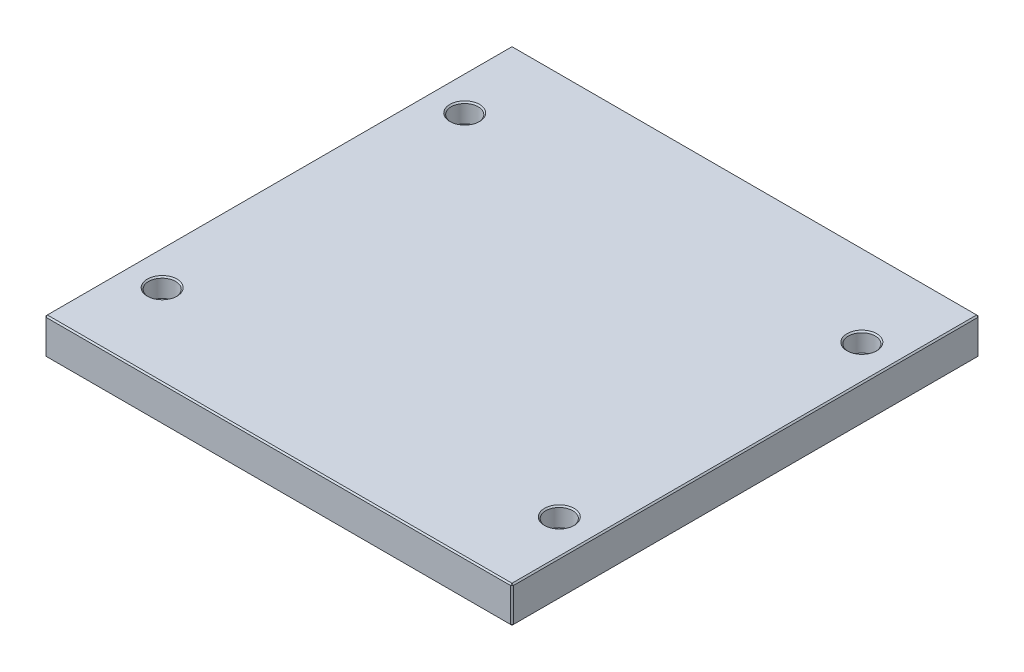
ISO-10303-21;
HEADER;
FILE_DESCRIPTION(('STEP AP214'),'2;1');
FILE_NAME('part.step','',(''),(''),'','','');
FILE_SCHEMA(('AUTOMOTIVE_DESIGN { 1 0 10303 214 1 1 1 1 }'));
ENDSEC;
DATA;
#1=APPLICATION_CONTEXT('core data for automotive mechanical design processes');
#2=APPLICATION_PROTOCOL_DEFINITION('international standard','automotive_design',2000,#1);
#3=PRODUCT_CONTEXT('',#1,'mechanical');
#4=PRODUCT('Part','Part','',(#3));
#5=PRODUCT_RELATED_PRODUCT_CATEGORY('part','',(#4));
#6=PRODUCT_DEFINITION_FORMATION('','',#4);
#7=PRODUCT_DEFINITION_CONTEXT('part definition',#1,'design');
#8=PRODUCT_DEFINITION('design','',#6,#7);
#9=PRODUCT_DEFINITION_SHAPE('','',#8);
#10=(LENGTH_UNIT() NAMED_UNIT(*) SI_UNIT(.MILLI.,.METRE.));
#11=(NAMED_UNIT(*) PLANE_ANGLE_UNIT() SI_UNIT($,.RADIAN.));
#12=(NAMED_UNIT(*) SI_UNIT($,.STERADIAN.) SOLID_ANGLE_UNIT());
#13=UNCERTAINTY_MEASURE_WITH_UNIT(LENGTH_MEASURE(1.E-05),#10,'distance_accuracy_value','');
#14=(GEOMETRIC_REPRESENTATION_CONTEXT(3) GLOBAL_UNCERTAINTY_ASSIGNED_CONTEXT((#13)) GLOBAL_UNIT_ASSIGNED_CONTEXT((#10,
#11,#12)) REPRESENTATION_CONTEXT('',''));
#15=CARTESIAN_POINT('',(0.,0.,0.));
#16=DIRECTION('',(0.,0.,1.));
#17=DIRECTION('',(1.,0.,0.));
#18=AXIS2_PLACEMENT_3D('',#15,#16,#17);
#19=CARTESIAN_POINT('',(-173.,27.,173.));
#20=DIRECTION('',(1.,0.,0.));
#21=DIRECTION('',(0.,0.,-1.));
#22=AXIS2_PLACEMENT_3D('',#19,#20,#21);
#23=PLANE('',#22);
#24=DIRECTION('',(0.,-1.,0.));
#25=VECTOR('',#24,1.);
#26=CARTESIAN_POINT('',(-173.,27.,-172.));
#27=LINE('',#26,#25);
#28=CARTESIAN_POINT('',(-173.,26.,-172.));
#29=VERTEX_POINT('',#28);
#30=CARTESIAN_POINT('',(-173.,0.999999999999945,-172.));
#31=VERTEX_POINT('',#30);
#32=EDGE_CURVE('E115',#29,#31,#27,.T.);
#33=ORIENTED_EDGE('',*,*,#32,.T.);
#34=DIRECTION('',(0.,0.,1.));
#35=VECTOR('',#34,1.);
#36=CARTESIAN_POINT('',(-173.,0.999999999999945,173.));
#37=LINE('',#36,#35);
#38=CARTESIAN_POINT('',(-173.,0.999999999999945,172.));
#39=VERTEX_POINT('',#38);
#40=EDGE_CURVE('E111',#31,#39,#37,.T.);
#41=ORIENTED_EDGE('',*,*,#40,.T.);
#42=DIRECTION('',(0.,1.,0.));
#43=VECTOR('',#42,1.);
#44=CARTESIAN_POINT('',(-173.,27.,172.));
#45=LINE('',#44,#43);
#46=CARTESIAN_POINT('',(-173.,26.,172.));
#47=VERTEX_POINT('',#46);
#48=EDGE_CURVE('E104',#39,#47,#45,.T.);
#49=ORIENTED_EDGE('',*,*,#48,.T.);
#50=DIRECTION('',(0.,0.,-1.));
#51=VECTOR('',#50,1.);
#52=CARTESIAN_POINT('',(-173.,26.,-173.));
#53=LINE('',#52,#51);
#54=EDGE_CURVE('E108',#47,#29,#53,.T.);
#55=ORIENTED_EDGE('',*,*,#54,.T.);
#56=EDGE_LOOP('',(#33,#41,#49,#55));
#57=FACE_BOUND('',#56,.T.);
#58=ADVANCED_FACE('F16',(#57),#23,.F.);
#59=CARTESIAN_POINT('',(173.,27.,173.));
#60=DIRECTION('',(0.,0.,-1.));
#61=DIRECTION('',(-1.,0.,0.));
#62=AXIS2_PLACEMENT_3D('',#59,#60,#61);
#63=PLANE('',#62);
#64=DIRECTION('',(-1.,0.,0.));
#65=VECTOR('',#64,1.);
#66=CARTESIAN_POINT('',(-173.,26.,173.));
#67=LINE('',#66,#65);
#68=CARTESIAN_POINT('',(172.,26.,173.));
#69=VERTEX_POINT('',#68);
#70=CARTESIAN_POINT('',(-172.,26.,173.));
#71=VERTEX_POINT('',#70);
#72=EDGE_CURVE('E170',#69,#71,#67,.T.);
#73=ORIENTED_EDGE('',*,*,#72,.T.);
#74=DIRECTION('',(0.,-1.,0.));
#75=VECTOR('',#74,1.);
#76=CARTESIAN_POINT('',(-172.,27.,173.));
#77=LINE('',#76,#75);
#78=CARTESIAN_POINT('',(-172.,1.,173.));
#79=VERTEX_POINT('',#78);
#80=EDGE_CURVE('E123',#71,#79,#77,.T.);
#81=ORIENTED_EDGE('',*,*,#80,.T.);
#82=DIRECTION('',(1.,0.,0.));
#83=VECTOR('',#82,1.);
#84=CARTESIAN_POINT('',(173.,1.,173.));
#85=LINE('',#84,#83);
#86=CARTESIAN_POINT('',(172.,1.,173.));
#87=VERTEX_POINT('',#86);
#88=EDGE_CURVE('E174',#79,#87,#85,.T.);
#89=ORIENTED_EDGE('',*,*,#88,.T.);
#90=DIRECTION('',(0.,1.,0.));
#91=VECTOR('',#90,1.);
#92=CARTESIAN_POINT('',(172.,27.,173.));
#93=LINE('',#92,#91);
#94=EDGE_CURVE('E172',#87,#69,#93,.T.);
#95=ORIENTED_EDGE('',*,*,#94,.T.);
#96=EDGE_LOOP('',(#73,#81,#89,#95));
#97=FACE_BOUND('',#96,.T.);
#98=ADVANCED_FACE('F317',(#97),#63,.F.);
#99=CARTESIAN_POINT('',(173.,27.,173.));
#100=DIRECTION('',(-1.,0.,0.));
#101=DIRECTION('',(0.,0.,1.));
#102=AXIS2_PLACEMENT_3D('',#99,#100,#101);
#103=PLANE('',#102);
#104=DIRECTION('',(0.,0.,-1.));
#105=VECTOR('',#104,1.);
#106=CARTESIAN_POINT('',(173.,1.,173.));
#107=LINE('',#106,#105);
#108=CARTESIAN_POINT('',(173.,1.,172.));
#109=VERTEX_POINT('',#108);
#110=CARTESIAN_POINT('',(173.,1.,-172.));
#111=VERTEX_POINT('',#110);
#112=EDGE_CURVE('E165',#109,#111,#107,.T.);
#113=ORIENTED_EDGE('',*,*,#112,.T.);
#114=DIRECTION('',(0.,1.,0.));
#115=VECTOR('',#114,1.);
#116=CARTESIAN_POINT('',(173.,27.,-172.));
#117=LINE('',#116,#115);
#118=CARTESIAN_POINT('',(173.,26.,-172.));
#119=VERTEX_POINT('',#118);
#120=EDGE_CURVE('E167',#111,#119,#117,.T.);
#121=ORIENTED_EDGE('',*,*,#120,.T.);
#122=DIRECTION('',(0.,0.,1.));
#123=VECTOR('',#122,1.);
#124=CARTESIAN_POINT('',(173.,26.,173.));
#125=LINE('',#124,#123);
#126=CARTESIAN_POINT('',(173.,26.,172.));
#127=VERTEX_POINT('',#126);
#128=EDGE_CURVE('E161',#119,#127,#125,.T.);
#129=ORIENTED_EDGE('',*,*,#128,.T.);
#130=DIRECTION('',(0.,-1.,0.));
#131=VECTOR('',#130,1.);
#132=CARTESIAN_POINT('',(173.,27.,172.));
#133=LINE('',#132,#131);
#134=EDGE_CURVE('E163',#127,#109,#133,.T.);
#135=ORIENTED_EDGE('',*,*,#134,.T.);
#136=EDGE_LOOP('',(#113,#121,#129,#135));
#137=FACE_BOUND('',#136,.T.);
#138=ADVANCED_FACE('F323',(#137),#103,.F.);
#139=CARTESIAN_POINT('',(173.,27.,-173.));
#140=DIRECTION('',(0.,0.,1.));
#141=DIRECTION('',(1.,0.,0.));
#142=AXIS2_PLACEMENT_3D('',#139,#140,#141);
#143=PLANE('',#142);
#144=DIRECTION('',(0.,-1.,0.));
#145=VECTOR('',#144,1.);
#146=CARTESIAN_POINT('',(172.,27.,-173.));
#147=LINE('',#146,#145);
#148=CARTESIAN_POINT('',(172.,26.,-173.));
#149=VERTEX_POINT('',#148);
#150=CARTESIAN_POINT('',(172.,1.,-173.));
#151=VERTEX_POINT('',#150);
#152=EDGE_CURVE('E154',#149,#151,#147,.T.);
#153=ORIENTED_EDGE('',*,*,#152,.T.);
#154=DIRECTION('',(-1.,0.,0.));
#155=VECTOR('',#154,1.);
#156=CARTESIAN_POINT('',(173.,1.,-173.));
#157=LINE('',#156,#155);
#158=CARTESIAN_POINT('',(-172.,1.,-173.));
#159=VERTEX_POINT('',#158);
#160=EDGE_CURVE('E159',#151,#159,#157,.T.);
#161=ORIENTED_EDGE('',*,*,#160,.T.);
#162=DIRECTION('',(0.,1.,0.));
#163=VECTOR('',#162,1.);
#164=CARTESIAN_POINT('',(-172.,27.,-173.));
#165=LINE('',#164,#163);
#166=CARTESIAN_POINT('',(-172.,26.,-173.));
#167=VERTEX_POINT('',#166);
#168=EDGE_CURVE('E156',#159,#167,#165,.T.);
#169=ORIENTED_EDGE('',*,*,#168,.T.);
#170=DIRECTION('',(1.,0.,0.));
#171=VECTOR('',#170,1.);
#172=CARTESIAN_POINT('',(173.,26.,-173.));
#173=LINE('',#172,#171);
#174=EDGE_CURVE('E152',#167,#149,#173,.T.);
#175=ORIENTED_EDGE('',*,*,#174,.T.);
#176=EDGE_LOOP('',(#153,#161,#169,#175));
#177=FACE_BOUND('',#176,.T.);
#178=ADVANCED_FACE('F465',(#177),#143,.F.);
#179=CARTESIAN_POINT('',(0.,27.,0.));
#180=DIRECTION('',(0.,1.,0.));
#181=DIRECTION('',(0.,0.,1.));
#182=AXIS2_PLACEMENT_3D('',#179,#180,#181);
#183=PLANE('',#182);
#184=CARTESIAN_POINT('',(-147.,27.,112.));
#185=DIRECTION('',(0.,1.,0.));
#186=DIRECTION('',(0.,0.,1.));
#187=AXIS2_PLACEMENT_3D('',#184,#185,#186);
#188=CIRCLE('',#187,11.0000000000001);
#189=CARTESIAN_POINT('',(-147.,27.,123.));
#190=VERTEX_POINT('',#189);
#191=EDGE_CURVE('E290',#190,#190,#188,.F.);
#192=ORIENTED_EDGE('',*,*,#191,.T.);
#193=EDGE_LOOP('',(#192));
#194=FACE_BOUND('',#193,.T.);
#195=CARTESIAN_POINT('',(147.,27.,112.));
#196=DIRECTION('',(0.,1.,0.));
#197=DIRECTION('',(0.,0.,1.));
#198=AXIS2_PLACEMENT_3D('',#195,#196,#197);
#199=CIRCLE('',#198,11.0000000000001);
#200=CARTESIAN_POINT('',(147.,27.,123.));
#201=VERTEX_POINT('',#200);
#202=EDGE_CURVE('E287',#201,#201,#199,.F.);
#203=ORIENTED_EDGE('',*,*,#202,.T.);
#204=EDGE_LOOP('',(#203));
#205=FACE_BOUND('',#204,.T.);
#206=CARTESIAN_POINT('',(147.,27.,-112.));
#207=DIRECTION('',(0.,1.,0.));
#208=DIRECTION('',(0.,0.,1.));
#209=AXIS2_PLACEMENT_3D('',#206,#207,#208);
#210=CIRCLE('',#209,11.0000000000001);
#211=CARTESIAN_POINT('',(147.,27.,-101.));
#212=VERTEX_POINT('',#211);
#213=EDGE_CURVE('E284',#212,#212,#210,.F.);
#214=ORIENTED_EDGE('',*,*,#213,.T.);
#215=EDGE_LOOP('',(#214));
#216=FACE_BOUND('',#215,.T.);
#217=CARTESIAN_POINT('',(-147.,27.,-112.));
#218=DIRECTION('',(0.,1.,0.));
#219=DIRECTION('',(0.,0.,1.));
#220=AXIS2_PLACEMENT_3D('',#217,#218,#219);
#221=CIRCLE('',#220,11.0000000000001);
#222=CARTESIAN_POINT('',(-147.,27.,-101.));
#223=VERTEX_POINT('',#222);
#224=EDGE_CURVE('E281',#223,#223,#221,.F.);
#225=ORIENTED_EDGE('',*,*,#224,.T.);
#226=EDGE_LOOP('',(#225));
#227=FACE_BOUND('',#226,.T.);
#228=DIRECTION('',(0.,0.,-1.));
#229=VECTOR('',#228,1.);
#230=CARTESIAN_POINT('',(172.,27.,-173.));
#231=LINE('',#230,#229);
#232=CARTESIAN_POINT('',(172.,27.,172.));
#233=VERTEX_POINT('',#232);
#234=CARTESIAN_POINT('',(172.,27.,-172.));
#235=VERTEX_POINT('',#234);
#236=EDGE_CURVE('E31',#233,#235,#231,.T.);
#237=ORIENTED_EDGE('',*,*,#236,.T.);
#238=DIRECTION('',(-1.,0.,0.));
#239=VECTOR('',#238,1.);
#240=CARTESIAN_POINT('',(-173.,27.,-172.));
#241=LINE('',#240,#239);
#242=CARTESIAN_POINT('',(-172.,27.,-172.));
#243=VERTEX_POINT('',#242);
#244=EDGE_CURVE('E190',#235,#243,#241,.T.);
#245=ORIENTED_EDGE('',*,*,#244,.T.);
#246=DIRECTION('',(0.,0.,1.));
#247=VECTOR('',#246,1.);
#248=CARTESIAN_POINT('',(-172.,27.,173.));
#249=LINE('',#248,#247);
#250=CARTESIAN_POINT('',(-172.,27.,172.));
#251=VERTEX_POINT('',#250);
#252=EDGE_CURVE('E186',#243,#251,#249,.T.);
#253=ORIENTED_EDGE('',*,*,#252,.T.);
#254=DIRECTION('',(1.,0.,0.));
#255=VECTOR('',#254,1.);
#256=CARTESIAN_POINT('',(173.,27.,172.));
#257=LINE('',#256,#255);
#258=EDGE_CURVE('E36',#251,#233,#257,.T.);
#259=ORIENTED_EDGE('',*,*,#258,.T.);
#260=EDGE_LOOP('',(#237,#245,#253,#259));
#261=FACE_BOUND('',#260,.T.);
#262=ADVANCED_FACE('F462',(#194,#205,#216,#227,#261),#183,.T.);
#263=CARTESIAN_POINT('',(0.,0.,0.));
#264=DIRECTION('',(0.,1.,0.));
#265=DIRECTION('',(0.,0.,1.));
#266=AXIS2_PLACEMENT_3D('',#263,#264,#265);
#267=PLANE('',#266);
#268=CARTESIAN_POINT('',(147.,0.,-112.));
#269=DIRECTION('',(0.,1.,0.));
#270=DIRECTION('',(0.,0.,1.));
#271=AXIS2_PLACEMENT_3D('',#268,#269,#270);
#272=CIRCLE('',#271,8.);
#273=CARTESIAN_POINT('',(147.,0.,-104.));
#274=VERTEX_POINT('',#273);
#275=EDGE_CURVE('E263',#274,#274,#272,.T.);
#276=ORIENTED_EDGE('',*,*,#275,.T.);
#277=EDGE_LOOP('',(#276));
#278=FACE_BOUND('',#277,.T.);
#279=CARTESIAN_POINT('',(147.,0.,112.));
#280=DIRECTION('',(0.,1.,0.));
#281=DIRECTION('',(0.,0.,1.));
#282=AXIS2_PLACEMENT_3D('',#279,#280,#281);
#283=CIRCLE('',#282,8.);
#284=CARTESIAN_POINT('',(147.,0.,120.));
#285=VERTEX_POINT('',#284);
#286=EDGE_CURVE('E260',#285,#285,#283,.T.);
#287=ORIENTED_EDGE('',*,*,#286,.T.);
#288=EDGE_LOOP('',(#287));
#289=FACE_BOUND('',#288,.T.);
#290=CARTESIAN_POINT('',(-147.,0.,112.));
#291=DIRECTION('',(0.,1.,0.));
#292=DIRECTION('',(0.,0.,1.));
#293=AXIS2_PLACEMENT_3D('',#290,#291,#292);
#294=CIRCLE('',#293,8.);
#295=CARTESIAN_POINT('',(-147.,0.,120.));
#296=VERTEX_POINT('',#295);
#297=EDGE_CURVE('E257',#296,#296,#294,.T.);
#298=ORIENTED_EDGE('',*,*,#297,.T.);
#299=EDGE_LOOP('',(#298));
#300=FACE_BOUND('',#299,.T.);
#301=CARTESIAN_POINT('',(-147.,0.,-112.));
#302=DIRECTION('',(0.,1.,0.));
#303=DIRECTION('',(0.,0.,1.));
#304=AXIS2_PLACEMENT_3D('',#301,#302,#303);
#305=CIRCLE('',#304,8.);
#306=CARTESIAN_POINT('',(-147.,0.,-104.));
#307=VERTEX_POINT('',#306);
#308=EDGE_CURVE('E192',#307,#307,#305,.T.);
#309=ORIENTED_EDGE('',*,*,#308,.T.);
#310=EDGE_LOOP('',(#309));
#311=FACE_BOUND('',#310,.T.);
#312=DIRECTION('',(0.,0.,1.));
#313=VECTOR('',#312,1.);
#314=CARTESIAN_POINT('',(172.,0.,0.));
#315=LINE('',#314,#313);
#316=CARTESIAN_POINT('',(172.,0.,-172.));
#317=VERTEX_POINT('',#316);
#318=CARTESIAN_POINT('',(172.,0.,172.));
#319=VERTEX_POINT('',#318);
#320=EDGE_CURVE('E177',#317,#319,#315,.T.);
#321=ORIENTED_EDGE('',*,*,#320,.T.);
#322=DIRECTION('',(-1.,0.,0.));
#323=VECTOR('',#322,1.);
#324=CARTESIAN_POINT('',(0.,0.,172.));
#325=LINE('',#324,#323);
#326=CARTESIAN_POINT('',(-172.,0.,172.));
#327=VERTEX_POINT('',#326);
#328=EDGE_CURVE('E183',#319,#327,#325,.T.);
#329=ORIENTED_EDGE('',*,*,#328,.T.);
#330=DIRECTION('',(0.,0.,-1.));
#331=VECTOR('',#330,1.);
#332=CARTESIAN_POINT('',(-172.,0.,0.));
#333=LINE('',#332,#331);
#334=CARTESIAN_POINT('',(-172.,0.,-172.));
#335=VERTEX_POINT('',#334);
#336=EDGE_CURVE('E181',#327,#335,#333,.T.);
#337=ORIENTED_EDGE('',*,*,#336,.T.);
#338=DIRECTION('',(1.,0.,0.));
#339=VECTOR('',#338,1.);
#340=CARTESIAN_POINT('',(0.,0.,-172.));
#341=LINE('',#340,#339);
#342=EDGE_CURVE('E179',#335,#317,#341,.T.);
#343=ORIENTED_EDGE('',*,*,#342,.T.);
#344=EDGE_LOOP('',(#321,#329,#337,#343));
#345=FACE_BOUND('',#344,.T.);
#346=ADVANCED_FACE('F402',(#278,#289,#300,#311,#345),#267,.F.);
#347=CARTESIAN_POINT('',(173.,27.,172.));
#348=DIRECTION('',(-0.707106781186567,0.,-0.707106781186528));
#349=DIRECTION('',(0.,-1.,0.));
#350=AXIS2_PLACEMENT_3D('',#347,#348,#349);
#351=PLANE('',#350);
#352=DIRECTION('',(-0.707106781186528,0.,0.707106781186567));
#353=VECTOR('',#352,1.);
#354=CARTESIAN_POINT('',(172.,26.,173.));
#355=LINE('',#354,#353);
#356=EDGE_CURVE('E141',#69,#127,#355,.F.);
#357=ORIENTED_EDGE('',*,*,#356,.F.);
#358=ORIENTED_EDGE('',*,*,#94,.F.);
#359=DIRECTION('',(0.707106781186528,0.,-0.707106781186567));
#360=VECTOR('',#359,1.);
#361=CARTESIAN_POINT('',(172.,1.,173.));
#362=LINE('',#361,#360);
#363=EDGE_CURVE('E144',#109,#87,#362,.F.);
#364=ORIENTED_EDGE('',*,*,#363,.F.);
#365=ORIENTED_EDGE('',*,*,#134,.F.);
#366=EDGE_LOOP('',(#357,#358,#364,#365));
#367=FACE_BOUND('',#366,.T.);
#368=ADVANCED_FACE('F398',(#367),#351,.F.);
#369=CARTESIAN_POINT('',(172.,26.,173.));
#370=DIRECTION('',(0.577350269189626,0.577350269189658,0.577350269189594));
#371=DIRECTION('',(-0.707106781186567,0.707106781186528,0.));
#372=AXIS2_PLACEMENT_3D('',#369,#370,#371);
#373=PLANE('',#372);
#374=DIRECTION('',(0.,-0.707106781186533,0.707106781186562));
#375=VECTOR('',#374,1.);
#376=CARTESIAN_POINT('',(172.,26.,173.));
#377=LINE('',#376,#375);
#378=EDGE_CURVE('E235',#69,#233,#377,.F.);
#379=ORIENTED_EDGE('',*,*,#378,.F.);
#380=ORIENTED_EDGE('',*,*,#356,.T.);
#381=DIRECTION('',(-0.707106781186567,0.707106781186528,0.));
#382=VECTOR('',#381,1.);
#383=CARTESIAN_POINT('',(172.5,26.5,172.));
#384=LINE('',#383,#382);
#385=EDGE_CURVE('E237',#233,#127,#384,.F.);
#386=ORIENTED_EDGE('',*,*,#385,.F.);
#387=EDGE_LOOP('',(#379,#380,#386));
#388=FACE_BOUND('',#387,.T.);
#389=ADVANCED_FACE('F394',(#388),#373,.T.);
#390=CARTESIAN_POINT('',(172.,1.,173.));
#391=DIRECTION('',(0.577350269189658,-0.577350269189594,0.577350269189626));
#392=DIRECTION('',(0.707106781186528,0.,-0.707106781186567));
#393=AXIS2_PLACEMENT_3D('',#390,#391,#392);
#394=PLANE('',#393);
#395=DIRECTION('',(-0.707106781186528,-0.707106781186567,0.));
#396=VECTOR('',#395,1.);
#397=CARTESIAN_POINT('',(172.5,0.5,172.));
#398=LINE('',#397,#396);
#399=EDGE_CURVE('E229',#109,#319,#398,.T.);
#400=ORIENTED_EDGE('',*,*,#399,.F.);
#401=ORIENTED_EDGE('',*,*,#363,.T.);
#402=DIRECTION('',(0.,0.707106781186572,0.707106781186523));
#403=VECTOR('',#402,1.);
#404=CARTESIAN_POINT('',(172.,1.,173.));
#405=LINE('',#404,#403);
#406=EDGE_CURVE('E232',#319,#87,#405,.T.);
#407=ORIENTED_EDGE('',*,*,#406,.F.);
#408=EDGE_LOOP('',(#400,#401,#407));
#409=FACE_BOUND('',#408,.T.);
#410=ADVANCED_FACE('F390',(#409),#394,.T.);
#411=CARTESIAN_POINT('',(172.,27.,0.));
#412=DIRECTION('',(0.707106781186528,0.707106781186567,0.));
#413=DIRECTION('',(0.,0.,1.));
#414=AXIS2_PLACEMENT_3D('',#411,#412,#413);
#415=PLANE('',#414);
#416=ORIENTED_EDGE('',*,*,#385,.T.);
#417=ORIENTED_EDGE('',*,*,#128,.F.);
#418=DIRECTION('',(0.707106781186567,-0.707106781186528,0.));
#419=VECTOR('',#418,1.);
#420=CARTESIAN_POINT('',(173.,26.,-172.));
#421=LINE('',#420,#419);
#422=EDGE_CURVE('E224',#235,#119,#421,.T.);
#423=ORIENTED_EDGE('',*,*,#422,.F.);
#424=ORIENTED_EDGE('',*,*,#236,.F.);
#425=EDGE_LOOP('',(#416,#417,#423,#424));
#426=FACE_BOUND('',#425,.T.);
#427=ADVANCED_FACE('F386',(#426),#415,.T.);
#428=CARTESIAN_POINT('',(0.,27.,172.));
#429=DIRECTION('',(0.,0.707106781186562,0.707106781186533));
#430=DIRECTION('',(-1.,0.,0.));
#431=AXIS2_PLACEMENT_3D('',#428,#429,#430);
#432=PLANE('',#431);
#433=ORIENTED_EDGE('',*,*,#378,.T.);
#434=ORIENTED_EDGE('',*,*,#258,.F.);
#435=DIRECTION('',(0.,0.707106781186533,-0.707106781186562));
#436=VECTOR('',#435,1.);
#437=CARTESIAN_POINT('',(-172.,26.5,172.5));
#438=LINE('',#437,#436);
#439=EDGE_CURVE('E127',#71,#251,#438,.T.);
#440=ORIENTED_EDGE('',*,*,#439,.F.);
#441=ORIENTED_EDGE('',*,*,#72,.F.);
#442=EDGE_LOOP('',(#433,#434,#440,#441));
#443=FACE_BOUND('',#442,.T.);
#444=ADVANCED_FACE('F383',(#443),#432,.T.);
#445=CARTESIAN_POINT('',(-172.,27.,173.));
#446=DIRECTION('',(0.707106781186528,0.,-0.707106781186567));
#447=DIRECTION('',(0.,-1.,0.));
#448=AXIS2_PLACEMENT_3D('',#445,#446,#447);
#449=PLANE('',#448);
#450=DIRECTION('',(0.707106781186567,0.,0.707106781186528));
#451=VECTOR('',#450,1.);
#452=CARTESIAN_POINT('',(-172.,1.,173.));
#453=LINE('',#452,#451);
#454=EDGE_CURVE('E128',#79,#39,#453,.F.);
#455=ORIENTED_EDGE('',*,*,#454,.F.);
#456=ORIENTED_EDGE('',*,*,#80,.F.);
#457=DIRECTION('',(-0.707106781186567,0.,-0.707106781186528));
#458=VECTOR('',#457,1.);
#459=CARTESIAN_POINT('',(-173.,26.,172.));
#460=LINE('',#459,#458);
#461=EDGE_CURVE('E119',#47,#71,#460,.F.);
#462=ORIENTED_EDGE('',*,*,#461,.F.);
#463=ORIENTED_EDGE('',*,*,#48,.F.);
#464=EDGE_LOOP('',(#455,#456,#462,#463));
#465=FACE_BOUND('',#464,.T.);
#466=ADVANCED_FACE('F121',(#465),#449,.F.);
#467=CARTESIAN_POINT('',(173.,1.,173.));
#468=DIRECTION('',(0.,0.707106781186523,-0.707106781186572));
#469=DIRECTION('',(1.,0.,0.));
#470=AXIS2_PLACEMENT_3D('',#467,#468,#469);
#471=PLANE('',#470);
#472=ORIENTED_EDGE('',*,*,#406,.T.);
#473=ORIENTED_EDGE('',*,*,#88,.F.);
#474=DIRECTION('',(0.,-0.707106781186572,-0.707106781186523));
#475=VECTOR('',#474,1.);
#476=CARTESIAN_POINT('',(-172.,1.,173.));
#477=LINE('',#476,#475);
#478=EDGE_CURVE('E220',#327,#79,#477,.F.);
#479=ORIENTED_EDGE('',*,*,#478,.F.);
#480=ORIENTED_EDGE('',*,*,#328,.F.);
#481=EDGE_LOOP('',(#472,#473,#479,#480));
#482=FACE_BOUND('',#481,.T.);
#483=ADVANCED_FACE('F376',(#482),#471,.F.);
#484=CARTESIAN_POINT('',(173.,1.,173.));
#485=DIRECTION('',(-0.707106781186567,0.707106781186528,0.));
#486=DIRECTION('',(0.,0.,-1.));
#487=AXIS2_PLACEMENT_3D('',#484,#485,#486);
#488=PLANE('',#487);
#489=ORIENTED_EDGE('',*,*,#399,.T.);
#490=ORIENTED_EDGE('',*,*,#320,.F.);
#491=DIRECTION('',(0.707106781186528,0.707106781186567,0.));
#492=VECTOR('',#491,1.);
#493=CARTESIAN_POINT('',(172.5,0.500000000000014,-172.));
#494=LINE('',#493,#492);
#495=EDGE_CURVE('E217',#111,#317,#494,.F.);
#496=ORIENTED_EDGE('',*,*,#495,.F.);
#497=ORIENTED_EDGE('',*,*,#112,.F.);
#498=EDGE_LOOP('',(#489,#490,#496,#497));
#499=FACE_BOUND('',#498,.T.);
#500=ADVANCED_FACE('F372',(#499),#488,.F.);
#501=CARTESIAN_POINT('',(172.,27.,-173.));
#502=DIRECTION('',(-0.707106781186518,0.,0.707106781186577));
#503=DIRECTION('',(0.,-1.,0.));
#504=AXIS2_PLACEMENT_3D('',#501,#502,#503);
#505=PLANE('',#504);
#506=DIRECTION('',(0.707106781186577,0.,0.707106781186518));
#507=VECTOR('',#506,1.);
#508=CARTESIAN_POINT('',(173.,26.,-172.));
#509=LINE('',#508,#507);
#510=EDGE_CURVE('E226',#119,#149,#509,.F.);
#511=ORIENTED_EDGE('',*,*,#510,.F.);
#512=ORIENTED_EDGE('',*,*,#120,.F.);
#513=DIRECTION('',(-0.707106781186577,0.,-0.707106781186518));
#514=VECTOR('',#513,1.);
#515=CARTESIAN_POINT('',(172.,1.,-173.));
#516=LINE('',#515,#514);
#517=EDGE_CURVE('E214',#151,#111,#516,.F.);
#518=ORIENTED_EDGE('',*,*,#517,.F.);
#519=ORIENTED_EDGE('',*,*,#152,.F.);
#520=EDGE_LOOP('',(#511,#512,#518,#519));
#521=FACE_BOUND('',#520,.T.);
#522=ADVANCED_FACE('F368',(#521),#505,.F.);
#523=CARTESIAN_POINT('',(173.,26.,-172.));
#524=DIRECTION('',(0.577350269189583,0.577350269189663,-0.577350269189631));
#525=DIRECTION('',(0.,0.707106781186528,0.707106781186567));
#526=AXIS2_PLACEMENT_3D('',#523,#524,#525);
#527=PLANE('',#526);
#528=ORIENTED_EDGE('',*,*,#422,.T.);
#529=ORIENTED_EDGE('',*,*,#510,.T.);
#530=DIRECTION('',(0.,0.707106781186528,0.707106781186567));
#531=VECTOR('',#530,1.);
#532=CARTESIAN_POINT('',(172.,26.5,-172.5));
#533=LINE('',#532,#531);
#534=EDGE_CURVE('E135',#235,#149,#533,.F.);
#535=ORIENTED_EDGE('',*,*,#534,.F.);
#536=EDGE_LOOP('',(#528,#529,#535));
#537=FACE_BOUND('',#536,.T.);
#538=ADVANCED_FACE('F365',(#537),#527,.T.);
#539=CARTESIAN_POINT('',(-173.,26.,172.));
#540=DIRECTION('',(-0.577350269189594,0.577350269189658,0.577350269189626));
#541=DIRECTION('',(0.,-0.707106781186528,0.707106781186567));
#542=AXIS2_PLACEMENT_3D('',#539,#540,#541);
#543=PLANE('',#542);
#544=ORIENTED_EDGE('',*,*,#461,.T.);
#545=ORIENTED_EDGE('',*,*,#439,.T.);
#546=DIRECTION('',(-0.707106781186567,-0.707106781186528,0.));
#547=VECTOR('',#546,1.);
#548=CARTESIAN_POINT('',(-173.,26.,172.));
#549=LINE('',#548,#547);
#550=EDGE_CURVE('E131',#47,#251,#549,.F.);
#551=ORIENTED_EDGE('',*,*,#550,.F.);
#552=EDGE_LOOP('',(#544,#545,#551));
#553=FACE_BOUND('',#552,.T.);
#554=ADVANCED_FACE('F132',(#553),#543,.T.);
#555=CARTESIAN_POINT('',(-172.,1.,173.));
#556=DIRECTION('',(-0.577350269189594,-0.577350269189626,0.577350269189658));
#557=DIRECTION('',(0.,-0.707106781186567,-0.707106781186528));
#558=AXIS2_PLACEMENT_3D('',#555,#556,#557);
#559=PLANE('',#558);
#560=ORIENTED_EDGE('',*,*,#478,.T.);
#561=ORIENTED_EDGE('',*,*,#454,.T.);
#562=DIRECTION('',(-0.707106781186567,0.707106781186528,0.));
#563=VECTOR('',#562,1.);
#564=CARTESIAN_POINT('',(-172.5,0.499999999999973,172.));
#565=LINE('',#564,#563);
#566=EDGE_CURVE('E136',#327,#39,#565,.T.);
#567=ORIENTED_EDGE('',*,*,#566,.F.);
#568=EDGE_LOOP('',(#560,#561,#567));
#569=FACE_BOUND('',#568,.T.);
#570=ADVANCED_FACE('F358',(#569),#559,.T.);
#571=CARTESIAN_POINT('',(172.,1.,-173.));
#572=DIRECTION('',(0.577350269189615,-0.577350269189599,-0.577350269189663));
#573=DIRECTION('',(-0.707106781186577,0.,-0.707106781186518));
#574=AXIS2_PLACEMENT_3D('',#571,#572,#573);
#575=PLANE('',#574);
#576=ORIENTED_EDGE('',*,*,#517,.T.);
#577=ORIENTED_EDGE('',*,*,#495,.T.);
#578=DIRECTION('',(0.,-0.707106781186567,0.707106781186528));
#579=VECTOR('',#578,1.);
#580=CARTESIAN_POINT('',(172.,1.,-173.));
#581=LINE('',#580,#579);
#582=EDGE_CURVE('E207',#151,#317,#581,.T.);
#583=ORIENTED_EDGE('',*,*,#582,.F.);
#584=EDGE_LOOP('',(#576,#577,#583));
#585=FACE_BOUND('',#584,.T.);
#586=ADVANCED_FACE('F354',(#585),#575,.T.);
#587=CARTESIAN_POINT('',(0.,27.,-172.));
#588=DIRECTION('',(0.,0.707106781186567,-0.707106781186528));
#589=DIRECTION('',(1.,0.,0.));
#590=AXIS2_PLACEMENT_3D('',#587,#588,#589);
#591=PLANE('',#590);
#592=ORIENTED_EDGE('',*,*,#534,.T.);
#593=ORIENTED_EDGE('',*,*,#174,.F.);
#594=DIRECTION('',(0.,-0.707106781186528,-0.707106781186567));
#595=VECTOR('',#594,1.);
#596=CARTESIAN_POINT('',(-172.,26.,-173.));
#597=LINE('',#596,#595);
#598=EDGE_CURVE('E204',#243,#167,#597,.T.);
#599=ORIENTED_EDGE('',*,*,#598,.F.);
#600=ORIENTED_EDGE('',*,*,#244,.F.);
#601=EDGE_LOOP('',(#592,#593,#599,#600));
#602=FACE_BOUND('',#601,.T.);
#603=ADVANCED_FACE('F351',(#602),#591,.T.);
#604=CARTESIAN_POINT('',(-172.,27.,0.));
#605=DIRECTION('',(-0.707106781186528,0.707106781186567,0.));
#606=DIRECTION('',(0.,0.,-1.));
#607=AXIS2_PLACEMENT_3D('',#604,#605,#606);
#608=PLANE('',#607);
#609=ORIENTED_EDGE('',*,*,#550,.T.);
#610=ORIENTED_EDGE('',*,*,#252,.F.);
#611=DIRECTION('',(0.707106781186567,0.707106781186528,0.));
#612=VECTOR('',#611,1.);
#613=CARTESIAN_POINT('',(-172.5,26.5,-172.));
#614=LINE('',#613,#612);
#615=EDGE_CURVE('E139',#29,#243,#614,.T.);
#616=ORIENTED_EDGE('',*,*,#615,.F.);
#617=ORIENTED_EDGE('',*,*,#54,.F.);
#618=EDGE_LOOP('',(#609,#610,#616,#617));
#619=FACE_BOUND('',#618,.T.);
#620=ADVANCED_FACE('F138',(#619),#608,.T.);
#621=CARTESIAN_POINT('',(-173.,0.999999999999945,173.));
#622=DIRECTION('',(0.707106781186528,0.707106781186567,0.));
#623=DIRECTION('',(0.,0.,1.));
#624=AXIS2_PLACEMENT_3D('',#621,#622,#623);
#625=PLANE('',#624);
#626=ORIENTED_EDGE('',*,*,#566,.T.);
#627=ORIENTED_EDGE('',*,*,#40,.F.);
#628=DIRECTION('',(0.707106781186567,-0.707106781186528,0.));
#629=VECTOR('',#628,1.);
#630=CARTESIAN_POINT('',(-173.,0.999999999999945,-172.));
#631=LINE('',#630,#629);
#632=EDGE_CURVE('E200',#335,#31,#631,.F.);
#633=ORIENTED_EDGE('',*,*,#632,.F.);
#634=ORIENTED_EDGE('',*,*,#336,.F.);
#635=EDGE_LOOP('',(#626,#627,#633,#634));
#636=FACE_BOUND('',#635,.T.);
#637=ADVANCED_FACE('F344',(#636),#625,.F.);
#638=CARTESIAN_POINT('',(173.,1.,-173.));
#639=DIRECTION('',(0.,0.707106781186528,0.707106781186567));
#640=DIRECTION('',(-1.,0.,0.));
#641=AXIS2_PLACEMENT_3D('',#638,#639,#640);
#642=PLANE('',#641);
#643=ORIENTED_EDGE('',*,*,#582,.T.);
#644=ORIENTED_EDGE('',*,*,#342,.F.);
#645=DIRECTION('',(0.,0.707106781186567,-0.707106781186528));
#646=VECTOR('',#645,1.);
#647=CARTESIAN_POINT('',(-172.,0.5,-172.5));
#648=LINE('',#647,#646);
#649=EDGE_CURVE('E197',#159,#335,#648,.F.);
#650=ORIENTED_EDGE('',*,*,#649,.F.);
#651=ORIENTED_EDGE('',*,*,#160,.F.);
#652=EDGE_LOOP('',(#643,#644,#650,#651));
#653=FACE_BOUND('',#652,.T.);
#654=ADVANCED_FACE('F340',(#653),#642,.F.);
#655=CARTESIAN_POINT('',(-172.,26.,-173.));
#656=DIRECTION('',(-0.577350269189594,0.577350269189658,-0.577350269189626));
#657=DIRECTION('',(0.,0.707106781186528,0.707106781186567));
#658=AXIS2_PLACEMENT_3D('',#655,#656,#657);
#659=PLANE('',#658);
#660=ORIENTED_EDGE('',*,*,#615,.T.);
#661=ORIENTED_EDGE('',*,*,#598,.T.);
#662=DIRECTION('',(0.707106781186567,0.,-0.707106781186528));
#663=VECTOR('',#662,1.);
#664=CARTESIAN_POINT('',(-172.,26.,-173.));
#665=LINE('',#664,#663);
#666=EDGE_CURVE('E195',#29,#167,#665,.T.);
#667=ORIENTED_EDGE('',*,*,#666,.F.);
#668=EDGE_LOOP('',(#660,#661,#667));
#669=FACE_BOUND('',#668,.T.);
#670=ADVANCED_FACE('F336',(#669),#659,.T.);
#671=CARTESIAN_POINT('',(-173.,0.999999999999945,-172.));
#672=DIRECTION('',(-0.577350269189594,-0.577350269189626,-0.577350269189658));
#673=DIRECTION('',(0.,0.707106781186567,-0.707106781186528));
#674=AXIS2_PLACEMENT_3D('',#671,#672,#673);
#675=PLANE('',#674);
#676=ORIENTED_EDGE('',*,*,#649,.T.);
#677=ORIENTED_EDGE('',*,*,#632,.T.);
#678=DIRECTION('',(-0.707106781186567,0.,0.707106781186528));
#679=VECTOR('',#678,1.);
#680=CARTESIAN_POINT('',(-173.,0.999999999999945,-172.));
#681=LINE('',#680,#679);
#682=EDGE_CURVE('E193',#159,#31,#681,.T.);
#683=ORIENTED_EDGE('',*,*,#682,.F.);
#684=EDGE_LOOP('',(#676,#677,#683));
#685=FACE_BOUND('',#684,.T.);
#686=ADVANCED_FACE('F332',(#685),#675,.T.);
#687=CARTESIAN_POINT('',(-173.,27.,-172.));
#688=DIRECTION('',(0.707106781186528,0.,0.707106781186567));
#689=DIRECTION('',(0.,-1.,0.));
#690=AXIS2_PLACEMENT_3D('',#687,#688,#689);
#691=PLANE('',#690);
#692=ORIENTED_EDGE('',*,*,#666,.T.);
#693=ORIENTED_EDGE('',*,*,#168,.F.);
#694=ORIENTED_EDGE('',*,*,#682,.T.);
#695=ORIENTED_EDGE('',*,*,#32,.F.);
#696=EDGE_LOOP('',(#692,#693,#694,#695));
#697=FACE_BOUND('',#696,.T.);
#698=ADVANCED_FACE('F328',(#697),#691,.F.);
#699=CARTESIAN_POINT('',(-147.,13.,-112.));
#700=DIRECTION('',(0.,1.,0.));
#701=DIRECTION('',(0.,0.,1.));
#702=AXIS2_PLACEMENT_3D('',#699,#700,#701);
#703=CYLINDRICAL_SURFACE('',#702,10.);
#704=CARTESIAN_POINT('',(-147.,26.,-112.));
#705=DIRECTION('',(0.,1.,0.));
#706=DIRECTION('',(0.,0.,1.));
#707=AXIS2_PLACEMENT_3D('',#704,#705,#706);
#708=CIRCLE('',#707,10.);
#709=CARTESIAN_POINT('',(-147.,26.,-102.));
#710=VERTEX_POINT('',#709);
#711=EDGE_CURVE('E10',#710,#710,#708,.T.);
#712=ORIENTED_EDGE('',*,*,#711,.T.);
#713=EDGE_LOOP('',(#712));
#714=FACE_BOUND('',#713,.T.);
#715=CARTESIAN_POINT('',(-147.,13.,-112.));
#716=DIRECTION('',(0.,1.,0.));
#717=DIRECTION('',(0.,0.,1.));
#718=AXIS2_PLACEMENT_3D('',#715,#716,#717);
#719=CIRCLE('',#718,10.);
#720=CARTESIAN_POINT('',(-147.,13.,-102.));
#721=VERTEX_POINT('',#720);
#722=EDGE_CURVE('E147',#721,#721,#719,.T.);
#723=ORIENTED_EDGE('',*,*,#722,.F.);
#724=EDGE_LOOP('',(#723));
#725=FACE_BOUND('',#724,.T.);
#726=ADVANCED_FACE('F331',(#714,#725),#703,.F.);
#727=CARTESIAN_POINT('',(-147.,13.,-112.));
#728=DIRECTION('',(0.,1.,0.));
#729=DIRECTION('',(0.,0.,1.));
#730=AXIS2_PLACEMENT_3D('',#727,#728,#729);
#731=PLANE('',#730);
#732=CARTESIAN_POINT('',(-147.,13.,-112.));
#733=DIRECTION('',(0.,1.,0.));
#734=DIRECTION('',(0.,0.,1.));
#735=AXIS2_PLACEMENT_3D('',#732,#733,#734);
#736=CIRCLE('',#735,7.);
#737=CARTESIAN_POINT('',(-147.,13.,-105.));
#738=VERTEX_POINT('',#737);
#739=EDGE_CURVE('E251',#738,#738,#736,.T.);
#740=ORIENTED_EDGE('',*,*,#739,.F.);
#741=EDGE_LOOP('',(#740));
#742=FACE_BOUND('',#741,.T.);
#743=ORIENTED_EDGE('',*,*,#722,.T.);
#744=EDGE_LOOP('',(#743));
#745=FACE_BOUND('',#744,.T.);
#746=ADVANCED_FACE('F450',(#742,#745),#731,.T.);
#747=CARTESIAN_POINT('',(147.,13.,-112.));
#748=DIRECTION('',(0.,1.,0.));
#749=DIRECTION('',(0.,0.,1.));
#750=AXIS2_PLACEMENT_3D('',#747,#748,#749);
#751=CYLINDRICAL_SURFACE('',#750,10.);
#752=CARTESIAN_POINT('',(147.,26.,-112.));
#753=DIRECTION('',(0.,1.,0.));
#754=DIRECTION('',(0.,0.,1.));
#755=AXIS2_PLACEMENT_3D('',#752,#753,#754);
#756=CIRCLE('',#755,10.);
#757=CARTESIAN_POINT('',(147.,26.,-102.));
#758=VERTEX_POINT('',#757);
#759=EDGE_CURVE('E24',#758,#758,#756,.T.);
#760=ORIENTED_EDGE('',*,*,#759,.T.);
#761=EDGE_LOOP('',(#760));
#762=FACE_BOUND('',#761,.T.);
#763=CARTESIAN_POINT('',(147.,13.,-112.));
#764=DIRECTION('',(0.,1.,0.));
#765=DIRECTION('',(0.,0.,1.));
#766=AXIS2_PLACEMENT_3D('',#763,#764,#765);
#767=CIRCLE('',#766,10.);
#768=CARTESIAN_POINT('',(147.,13.,-102.));
#769=VERTEX_POINT('',#768);
#770=EDGE_CURVE('E441',#769,#769,#767,.T.);
#771=ORIENTED_EDGE('',*,*,#770,.F.);
#772=EDGE_LOOP('',(#771));
#773=FACE_BOUND('',#772,.T.);
#774=ADVANCED_FACE('F298',(#762,#773),#751,.F.);
#775=CARTESIAN_POINT('',(147.,13.,-112.));
#776=DIRECTION('',(0.,1.,0.));
#777=DIRECTION('',(0.,0.,1.));
#778=AXIS2_PLACEMENT_3D('',#775,#776,#777);
#779=PLANE('',#778);
#780=CARTESIAN_POINT('',(147.,13.,-112.));
#781=DIRECTION('',(0.,1.,0.));
#782=DIRECTION('',(0.,0.,1.));
#783=AXIS2_PLACEMENT_3D('',#780,#781,#782);
#784=CIRCLE('',#783,7.);
#785=CARTESIAN_POINT('',(147.,13.,-105.));
#786=VERTEX_POINT('',#785);
#787=EDGE_CURVE('E248',#786,#786,#784,.T.);
#788=ORIENTED_EDGE('',*,*,#787,.F.);
#789=EDGE_LOOP('',(#788));
#790=FACE_BOUND('',#789,.T.);
#791=ORIENTED_EDGE('',*,*,#770,.T.);
#792=EDGE_LOOP('',(#791));
#793=FACE_BOUND('',#792,.T.);
#794=ADVANCED_FACE('F738',(#790,#793),#779,.T.);
#795=CARTESIAN_POINT('',(147.,13.,112.));
#796=DIRECTION('',(0.,1.,0.));
#797=DIRECTION('',(0.,0.,1.));
#798=AXIS2_PLACEMENT_3D('',#795,#796,#797);
#799=CYLINDRICAL_SURFACE('',#798,10.);
#800=CARTESIAN_POINT('',(147.,26.,112.));
#801=DIRECTION('',(0.,1.,0.));
#802=DIRECTION('',(0.,0.,1.));
#803=AXIS2_PLACEMENT_3D('',#800,#801,#802);
#804=CIRCLE('',#803,10.);
#805=CARTESIAN_POINT('',(147.,26.,122.));
#806=VERTEX_POINT('',#805);
#807=EDGE_CURVE('E293',#806,#806,#804,.T.);
#808=ORIENTED_EDGE('',*,*,#807,.T.);
#809=EDGE_LOOP('',(#808));
#810=FACE_BOUND('',#809,.T.);
#811=CARTESIAN_POINT('',(147.,13.,112.));
#812=DIRECTION('',(0.,1.,0.));
#813=DIRECTION('',(0.,0.,1.));
#814=AXIS2_PLACEMENT_3D('',#811,#812,#813);
#815=CIRCLE('',#814,10.);
#816=CARTESIAN_POINT('',(147.,13.,122.));
#817=VERTEX_POINT('',#816);
#818=EDGE_CURVE('E439',#817,#817,#815,.T.);
#819=ORIENTED_EDGE('',*,*,#818,.F.);
#820=EDGE_LOOP('',(#819));
#821=FACE_BOUND('',#820,.T.);
#822=ADVANCED_FACE('F730',(#810,#821),#799,.F.);
#823=CARTESIAN_POINT('',(147.,13.,112.));
#824=DIRECTION('',(0.,1.,0.));
#825=DIRECTION('',(0.,0.,1.));
#826=AXIS2_PLACEMENT_3D('',#823,#824,#825);
#827=PLANE('',#826);
#828=CARTESIAN_POINT('',(147.,13.,112.));
#829=DIRECTION('',(0.,1.,0.));
#830=DIRECTION('',(0.,0.,1.));
#831=AXIS2_PLACEMENT_3D('',#828,#829,#830);
#832=CIRCLE('',#831,7.);
#833=CARTESIAN_POINT('',(147.,13.,119.));
#834=VERTEX_POINT('',#833);
#835=EDGE_CURVE('E245',#834,#834,#832,.T.);
#836=ORIENTED_EDGE('',*,*,#835,.F.);
#837=EDGE_LOOP('',(#836));
#838=FACE_BOUND('',#837,.T.);
#839=ORIENTED_EDGE('',*,*,#818,.T.);
#840=EDGE_LOOP('',(#839));
#841=FACE_BOUND('',#840,.T.);
#842=ADVANCED_FACE('F434',(#838,#841),#827,.T.);
#843=CARTESIAN_POINT('',(-147.,13.,112.));
#844=DIRECTION('',(0.,1.,0.));
#845=DIRECTION('',(0.,0.,1.));
#846=AXIS2_PLACEMENT_3D('',#843,#844,#845);
#847=CYLINDRICAL_SURFACE('',#846,10.);
#848=CARTESIAN_POINT('',(-147.,26.,112.));
#849=DIRECTION('',(0.,1.,0.));
#850=DIRECTION('',(0.,0.,1.));
#851=AXIS2_PLACEMENT_3D('',#848,#849,#850);
#852=CIRCLE('',#851,10.);
#853=CARTESIAN_POINT('',(-147.,26.,122.));
#854=VERTEX_POINT('',#853);
#855=EDGE_CURVE('E278',#854,#854,#852,.T.);
#856=ORIENTED_EDGE('',*,*,#855,.T.);
#857=EDGE_LOOP('',(#856));
#858=FACE_BOUND('',#857,.T.);
#859=CARTESIAN_POINT('',(-147.,13.,112.));
#860=DIRECTION('',(0.,1.,0.));
#861=DIRECTION('',(0.,0.,1.));
#862=AXIS2_PLACEMENT_3D('',#859,#860,#861);
#863=CIRCLE('',#862,10.);
#864=CARTESIAN_POINT('',(-147.,13.,122.));
#865=VERTEX_POINT('',#864);
#866=EDGE_CURVE('E254',#865,#865,#863,.T.);
#867=ORIENTED_EDGE('',*,*,#866,.F.);
#868=EDGE_LOOP('',(#867));
#869=FACE_BOUND('',#868,.T.);
#870=ADVANCED_FACE('F430',(#858,#869),#847,.F.);
#871=CARTESIAN_POINT('',(-147.,13.,112.));
#872=DIRECTION('',(0.,1.,0.));
#873=DIRECTION('',(0.,0.,1.));
#874=AXIS2_PLACEMENT_3D('',#871,#872,#873);
#875=PLANE('',#874);
#876=CARTESIAN_POINT('',(-147.,13.,112.));
#877=DIRECTION('',(0.,1.,0.));
#878=DIRECTION('',(0.,0.,1.));
#879=AXIS2_PLACEMENT_3D('',#876,#877,#878);
#880=CIRCLE('',#879,7.);
#881=CARTESIAN_POINT('',(-147.,13.,119.));
#882=VERTEX_POINT('',#881);
#883=EDGE_CURVE('E242',#882,#882,#880,.T.);
#884=ORIENTED_EDGE('',*,*,#883,.F.);
#885=EDGE_LOOP('',(#884));
#886=FACE_BOUND('',#885,.T.);
#887=ORIENTED_EDGE('',*,*,#866,.T.);
#888=EDGE_LOOP('',(#887));
#889=FACE_BOUND('',#888,.T.);
#890=ADVANCED_FACE('F433',(#886,#889),#875,.T.);
#891=CARTESIAN_POINT('',(-147.,0.,112.));
#892=DIRECTION('',(0.,1.,0.));
#893=DIRECTION('',(0.,0.,1.));
#894=AXIS2_PLACEMENT_3D('',#891,#892,#893);
#895=CYLINDRICAL_SURFACE('',#894,7.);
#896=CARTESIAN_POINT('',(-147.,0.99999999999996,112.));
#897=DIRECTION('',(0.,1.,0.));
#898=DIRECTION('',(0.,0.,1.));
#899=AXIS2_PLACEMENT_3D('',#896,#897,#898);
#900=CIRCLE('',#899,7.);
#901=CARTESIAN_POINT('',(-147.,0.99999999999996,119.));
#902=VERTEX_POINT('',#901);
#903=EDGE_CURVE('E272',#902,#902,#900,.F.);
#904=ORIENTED_EDGE('',*,*,#903,.T.);
#905=EDGE_LOOP('',(#904));
#906=FACE_BOUND('',#905,.T.);
#907=ORIENTED_EDGE('',*,*,#883,.T.);
#908=EDGE_LOOP('',(#907));
#909=FACE_BOUND('',#908,.T.);
#910=ADVANCED_FACE('F705',(#906,#909),#895,.F.);
#911=CARTESIAN_POINT('',(147.,0.,112.));
#912=DIRECTION('',(0.,1.,0.));
#913=DIRECTION('',(0.,0.,1.));
#914=AXIS2_PLACEMENT_3D('',#911,#912,#913);
#915=CYLINDRICAL_SURFACE('',#914,7.);
#916=CARTESIAN_POINT('',(147.,0.999999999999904,112.));
#917=DIRECTION('',(0.,1.,0.));
#918=DIRECTION('',(0.,0.,1.));
#919=AXIS2_PLACEMENT_3D('',#916,#917,#918);
#920=CIRCLE('',#919,7.);
#921=CARTESIAN_POINT('',(147.,0.999999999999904,119.));
#922=VERTEX_POINT('',#921);
#923=EDGE_CURVE('E269',#922,#922,#920,.F.);
#924=ORIENTED_EDGE('',*,*,#923,.T.);
#925=EDGE_LOOP('',(#924));
#926=FACE_BOUND('',#925,.T.);
#927=ORIENTED_EDGE('',*,*,#835,.T.);
#928=EDGE_LOOP('',(#927));
#929=FACE_BOUND('',#928,.T.);
#930=ADVANCED_FACE('F697',(#926,#929),#915,.F.);
#931=CARTESIAN_POINT('',(147.,0.,-112.));
#932=DIRECTION('',(0.,1.,0.));
#933=DIRECTION('',(0.,0.,1.));
#934=AXIS2_PLACEMENT_3D('',#931,#932,#933);
#935=CYLINDRICAL_SURFACE('',#934,7.);
#936=CARTESIAN_POINT('',(147.,0.999999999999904,-112.));
#937=DIRECTION('',(0.,1.,0.));
#938=DIRECTION('',(0.,0.,1.));
#939=AXIS2_PLACEMENT_3D('',#936,#937,#938);
#940=CIRCLE('',#939,7.);
#941=CARTESIAN_POINT('',(147.,0.999999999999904,-105.));
#942=VERTEX_POINT('',#941);
#943=EDGE_CURVE('E266',#942,#942,#940,.F.);
#944=ORIENTED_EDGE('',*,*,#943,.T.);
#945=EDGE_LOOP('',(#944));
#946=FACE_BOUND('',#945,.T.);
#947=ORIENTED_EDGE('',*,*,#787,.T.);
#948=EDGE_LOOP('',(#947));
#949=FACE_BOUND('',#948,.T.);
#950=ADVANCED_FACE('F688',(#946,#949),#935,.F.);
#951=CARTESIAN_POINT('',(-147.,0.,-112.));
#952=DIRECTION('',(0.,1.,0.));
#953=DIRECTION('',(0.,0.,1.));
#954=AXIS2_PLACEMENT_3D('',#951,#952,#953);
#955=CYLINDRICAL_SURFACE('',#954,7.);
#956=CARTESIAN_POINT('',(-147.,0.99999999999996,-112.));
#957=DIRECTION('',(0.,1.,0.));
#958=DIRECTION('',(0.,0.,1.));
#959=AXIS2_PLACEMENT_3D('',#956,#957,#958);
#960=CIRCLE('',#959,7.);
#961=CARTESIAN_POINT('',(-147.,0.99999999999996,-105.));
#962=VERTEX_POINT('',#961);
#963=EDGE_CURVE('E275',#962,#962,#960,.F.);
#964=ORIENTED_EDGE('',*,*,#963,.T.);
#965=EDGE_LOOP('',(#964));
#966=FACE_BOUND('',#965,.T.);
#967=ORIENTED_EDGE('',*,*,#739,.T.);
#968=EDGE_LOOP('',(#967));
#969=FACE_BOUND('',#968,.T.);
#970=ADVANCED_FACE('F408',(#966,#969),#955,.F.);
#971=CARTESIAN_POINT('',(147.,0.,-112.));
#972=DIRECTION('',(0.,-1.,0.));
#973=DIRECTION('',(0.,0.,-1.));
#974=AXIS2_PLACEMENT_3D('',#971,#972,#973);
#975=CONICAL_SURFACE('',#974,8.,0.785398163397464);
#976=ORIENTED_EDGE('',*,*,#943,.F.);
#977=EDGE_LOOP('',(#976));
#978=FACE_BOUND('',#977,.T.);
#979=ORIENTED_EDGE('',*,*,#275,.F.);
#980=EDGE_LOOP('',(#979));
#981=FACE_BOUND('',#980,.T.);
#982=ADVANCED_FACE('F404',(#978,#981),#975,.F.);
#983=CARTESIAN_POINT('',(147.,0.,112.));
#984=DIRECTION('',(0.,-1.,0.));
#985=DIRECTION('',(0.,0.,-1.));
#986=AXIS2_PLACEMENT_3D('',#983,#984,#985);
#987=CONICAL_SURFACE('',#986,8.,0.785398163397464);
#988=ORIENTED_EDGE('',*,*,#923,.F.);
#989=EDGE_LOOP('',(#988));
#990=FACE_BOUND('',#989,.T.);
#991=ORIENTED_EDGE('',*,*,#286,.F.);
#992=EDGE_LOOP('',(#991));
#993=FACE_BOUND('',#992,.T.);
#994=ADVANCED_FACE('F407',(#990,#993),#987,.F.);
#995=CARTESIAN_POINT('',(-147.,0.,112.));
#996=DIRECTION('',(0.,-1.,0.));
#997=DIRECTION('',(0.,0.,-1.));
#998=AXIS2_PLACEMENT_3D('',#995,#996,#997);
#999=CONICAL_SURFACE('',#998,8.,0.785398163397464);
#1000=ORIENTED_EDGE('',*,*,#903,.F.);
#1001=EDGE_LOOP('',(#1000));
#1002=FACE_BOUND('',#1001,.T.);
#1003=ORIENTED_EDGE('',*,*,#297,.F.);
#1004=EDGE_LOOP('',(#1003));
#1005=FACE_BOUND('',#1004,.T.);
#1006=ADVANCED_FACE('F412',(#1002,#1005),#999,.F.);
#1007=CARTESIAN_POINT('',(-147.,0.,-112.));
#1008=DIRECTION('',(0.,-1.,0.));
#1009=DIRECTION('',(0.,0.,-1.));
#1010=AXIS2_PLACEMENT_3D('',#1007,#1008,#1009);
#1011=CONICAL_SURFACE('',#1010,8.,0.785398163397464);
#1012=ORIENTED_EDGE('',*,*,#963,.F.);
#1013=EDGE_LOOP('',(#1012));
#1014=FACE_BOUND('',#1013,.T.);
#1015=ORIENTED_EDGE('',*,*,#308,.F.);
#1016=EDGE_LOOP('',(#1015));
#1017=FACE_BOUND('',#1016,.T.);
#1018=ADVANCED_FACE('F416',(#1014,#1017),#1011,.F.);
#1019=CARTESIAN_POINT('',(-147.,26.,112.));
#1020=DIRECTION('',(0.,1.,0.));
#1021=DIRECTION('',(0.,0.,1.));
#1022=AXIS2_PLACEMENT_3D('',#1019,#1020,#1021);
#1023=CONICAL_SURFACE('',#1022,10.,0.785398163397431);
#1024=ORIENTED_EDGE('',*,*,#191,.F.);
#1025=EDGE_LOOP('',(#1024));
#1026=FACE_BOUND('',#1025,.T.);
#1027=ORIENTED_EDGE('',*,*,#855,.F.);
#1028=EDGE_LOOP('',(#1027));
#1029=FACE_BOUND('',#1028,.T.);
#1030=ADVANCED_FACE('F312',(#1026,#1029),#1023,.F.);
#1031=CARTESIAN_POINT('',(147.,26.,112.));
#1032=DIRECTION('',(0.,1.,0.));
#1033=DIRECTION('',(0.,0.,1.));
#1034=AXIS2_PLACEMENT_3D('',#1031,#1032,#1033);
#1035=CONICAL_SURFACE('',#1034,10.,0.785398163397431);
#1036=ORIENTED_EDGE('',*,*,#202,.F.);
#1037=EDGE_LOOP('',(#1036));
#1038=FACE_BOUND('',#1037,.T.);
#1039=ORIENTED_EDGE('',*,*,#807,.F.);
#1040=EDGE_LOOP('',(#1039));
#1041=FACE_BOUND('',#1040,.T.);
#1042=ADVANCED_FACE('F303',(#1038,#1041),#1035,.F.);
#1043=CARTESIAN_POINT('',(147.,26.,-112.));
#1044=DIRECTION('',(0.,1.,0.));
#1045=DIRECTION('',(0.,0.,1.));
#1046=AXIS2_PLACEMENT_3D('',#1043,#1044,#1045);
#1047=CONICAL_SURFACE('',#1046,10.,0.785398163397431);
#1048=ORIENTED_EDGE('',*,*,#213,.F.);
#1049=EDGE_LOOP('',(#1048));
#1050=FACE_BOUND('',#1049,.T.);
#1051=ORIENTED_EDGE('',*,*,#759,.F.);
#1052=EDGE_LOOP('',(#1051));
#1053=FACE_BOUND('',#1052,.T.);
#1054=ADVANCED_FACE('F301',(#1050,#1053),#1047,.F.);
#1055=CARTESIAN_POINT('',(-147.,26.,-112.));
#1056=DIRECTION('',(0.,1.,0.));
#1057=DIRECTION('',(0.,0.,1.));
#1058=AXIS2_PLACEMENT_3D('',#1055,#1056,#1057);
#1059=CONICAL_SURFACE('',#1058,10.,0.785398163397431);
#1060=ORIENTED_EDGE('',*,*,#224,.F.);
#1061=EDGE_LOOP('',(#1060));
#1062=FACE_BOUND('',#1061,.T.);
#1063=ORIENTED_EDGE('',*,*,#711,.F.);
#1064=EDGE_LOOP('',(#1063));
#1065=FACE_BOUND('',#1064,.T.);
#1066=ADVANCED_FACE('F18',(#1062,#1065),#1059,.F.);
#1067=CLOSED_SHELL('',(#58,#98,#138,#178,#262,#346,#368,#389,#410,#427,#444,#466,#483,#500,#522,
#538,#554,#570,#586,#603,#620,#637,#654,#670,#686,#698,#726,#746,#774,#794,#822,#842,#870,#890,
#910,#930,#950,#970,#982,#994,#1006,#1018,#1030,#1042,#1054,#1066));
#1068=MANIFOLD_SOLID_BREP('B1',#1067);
#1069=ADVANCED_BREP_SHAPE_REPRESENTATION('',(#18,#1068),#14);
#1070=SHAPE_DEFINITION_REPRESENTATION(#9,#1069);
ENDSEC;
END-ISO-10303-21;
